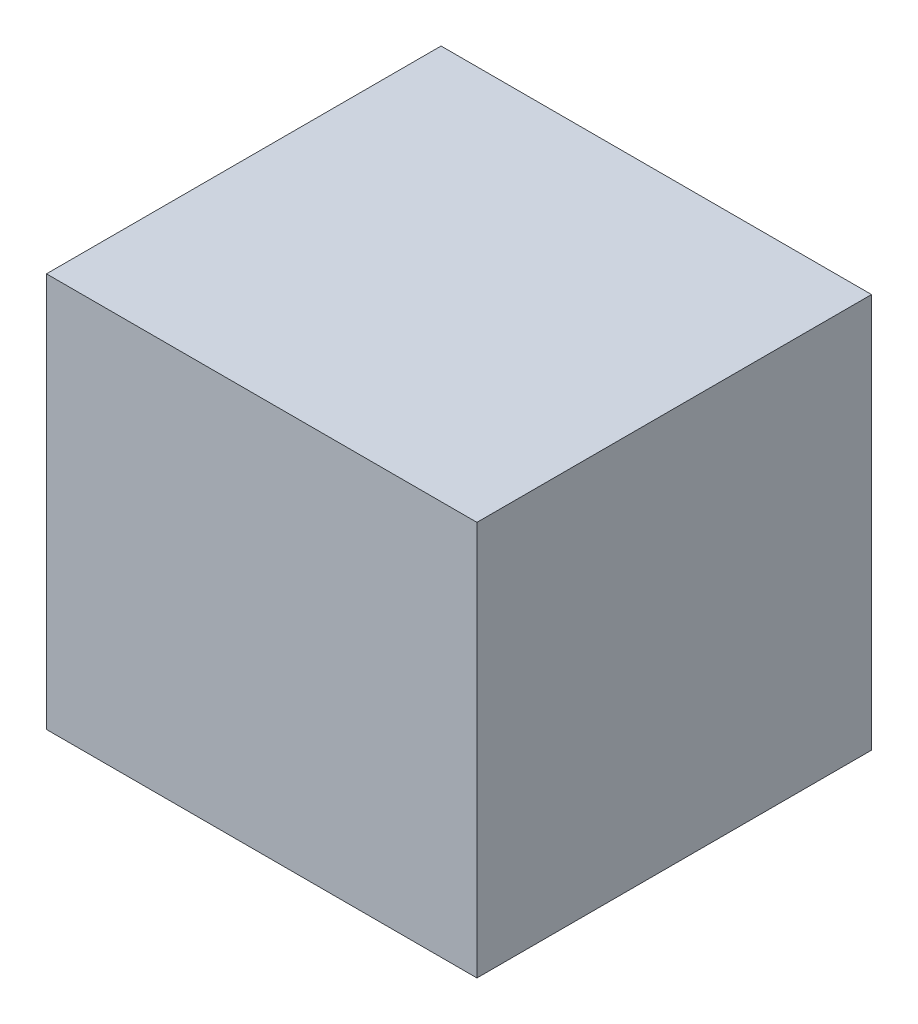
ISO-10303-21;
HEADER;
FILE_DESCRIPTION(('STEP AP214'),'2;1');
FILE_NAME('part.step','',(''),(''),'','','');
FILE_SCHEMA(('AUTOMOTIVE_DESIGN { 1 0 10303 214 1 1 1 1 }'));
ENDSEC;
DATA;
#1=APPLICATION_CONTEXT('core data for automotive mechanical design processes');
#2=APPLICATION_PROTOCOL_DEFINITION('international standard','automotive_design',2000,#1);
#3=PRODUCT_CONTEXT('',#1,'mechanical');
#4=PRODUCT('Part','Part','',(#3));
#5=PRODUCT_RELATED_PRODUCT_CATEGORY('part','',(#4));
#6=PRODUCT_DEFINITION_FORMATION('','',#4);
#7=PRODUCT_DEFINITION_CONTEXT('part definition',#1,'design');
#8=PRODUCT_DEFINITION('design','',#6,#7);
#9=PRODUCT_DEFINITION_SHAPE('','',#8);
#10=(LENGTH_UNIT() NAMED_UNIT(*) SI_UNIT(.MILLI.,.METRE.));
#11=(NAMED_UNIT(*) PLANE_ANGLE_UNIT() SI_UNIT($,.RADIAN.));
#12=(NAMED_UNIT(*) SI_UNIT($,.STERADIAN.) SOLID_ANGLE_UNIT());
#13=UNCERTAINTY_MEASURE_WITH_UNIT(LENGTH_MEASURE(1.E-05),#10,'distance_accuracy_value','');
#14=(GEOMETRIC_REPRESENTATION_CONTEXT(3) GLOBAL_UNCERTAINTY_ASSIGNED_CONTEXT((#13)) GLOBAL_UNIT_ASSIGNED_CONTEXT((#10,
#11,#12)) REPRESENTATION_CONTEXT('',''));
#15=CARTESIAN_POINT('',(0.,0.,0.));
#16=DIRECTION('',(0.,0.,1.));
#17=DIRECTION('',(1.,0.,0.));
#18=AXIS2_PLACEMENT_3D('',#15,#16,#17);
#19=CARTESIAN_POINT('',(120.,0.,0.));
#20=DIRECTION('',(0.,0.,-1.));
#21=DIRECTION('',(-1.,0.,0.));
#22=AXIS2_PLACEMENT_3D('',#19,#20,#21);
#23=PLANE('',#22);
#24=DIRECTION('',(0.,-1.,0.));
#25=VECTOR('',#24,1.);
#26=CARTESIAN_POINT('',(0.,0.,0.));
#27=LINE('',#26,#25);
#28=CARTESIAN_POINT('',(0.,110.,0.));
#29=VERTEX_POINT('',#28);
#30=CARTESIAN_POINT('',(0.,0.,0.));
#31=VERTEX_POINT('',#30);
#32=EDGE_CURVE('E107',#29,#31,#27,.T.);
#33=ORIENTED_EDGE('',*,*,#32,.T.);
#34=DIRECTION('',(-1.,0.,0.));
#35=VECTOR('',#34,1.);
#36=CARTESIAN_POINT('',(120.,0.,0.));
#37=LINE('',#36,#35);
#38=CARTESIAN_POINT('',(120.,0.,0.));
#39=VERTEX_POINT('',#38);
#40=EDGE_CURVE('E11',#39,#31,#37,.T.);
#41=ORIENTED_EDGE('',*,*,#40,.F.);
#42=DIRECTION('',(0.,-1.,0.));
#43=VECTOR('',#42,1.);
#44=CARTESIAN_POINT('',(120.,0.,0.));
#45=LINE('',#44,#43);
#46=CARTESIAN_POINT('',(120.,110.,0.));
#47=VERTEX_POINT('',#46);
#48=EDGE_CURVE('E91',#47,#39,#45,.T.);
#49=ORIENTED_EDGE('',*,*,#48,.F.);
#50=DIRECTION('',(-1.,0.,0.));
#51=VECTOR('',#50,1.);
#52=CARTESIAN_POINT('',(120.,110.,0.));
#53=LINE('',#52,#51);
#54=EDGE_CURVE('E103',#47,#29,#53,.T.);
#55=ORIENTED_EDGE('',*,*,#54,.T.);
#56=EDGE_LOOP('',(#33,#41,#49,#55));
#57=FACE_BOUND('',#56,.T.);
#58=ADVANCED_FACE('F39',(#57),#23,.F.);
#59=CARTESIAN_POINT('',(120.,0.,0.));
#60=DIRECTION('',(0.,1.,0.));
#61=DIRECTION('',(0.,0.,1.));
#62=AXIS2_PLACEMENT_3D('',#59,#60,#61);
#63=PLANE('',#62);
#64=DIRECTION('',(0.,0.,-1.));
#65=VECTOR('',#64,1.);
#66=CARTESIAN_POINT('',(0.,0.,0.));
#67=LINE('',#66,#65);
#68=CARTESIAN_POINT('',(0.,0.,-110.));
#69=VERTEX_POINT('',#68);
#70=EDGE_CURVE('E96',#31,#69,#67,.T.);
#71=ORIENTED_EDGE('',*,*,#70,.T.);
#72=DIRECTION('',(-1.,0.,0.));
#73=VECTOR('',#72,1.);
#74=CARTESIAN_POINT('',(120.,0.,-110.));
#75=LINE('',#74,#73);
#76=CARTESIAN_POINT('',(120.,0.,-110.));
#77=VERTEX_POINT('',#76);
#78=EDGE_CURVE('E48',#77,#69,#75,.T.);
#79=ORIENTED_EDGE('',*,*,#78,.F.);
#80=DIRECTION('',(0.,0.,-1.));
#81=VECTOR('',#80,1.);
#82=CARTESIAN_POINT('',(120.,0.,0.));
#83=LINE('',#82,#81);
#84=EDGE_CURVE('E86',#39,#77,#83,.T.);
#85=ORIENTED_EDGE('',*,*,#84,.F.);
#86=ORIENTED_EDGE('',*,*,#40,.T.);
#87=EDGE_LOOP('',(#71,#79,#85,#86));
#88=FACE_BOUND('',#87,.T.);
#89=ADVANCED_FACE('F95',(#88),#63,.F.);
#90=CARTESIAN_POINT('',(120.,0.,-110.));
#91=DIRECTION('',(0.,0.,1.));
#92=DIRECTION('',(1.,0.,0.));
#93=AXIS2_PLACEMENT_3D('',#90,#91,#92);
#94=PLANE('',#93);
#95=DIRECTION('',(0.,1.,0.));
#96=VECTOR('',#95,1.);
#97=CARTESIAN_POINT('',(0.,0.,-110.));
#98=LINE('',#97,#96);
#99=CARTESIAN_POINT('',(0.,110.,-110.));
#100=VERTEX_POINT('',#99);
#101=EDGE_CURVE('E73',#69,#100,#98,.T.);
#102=ORIENTED_EDGE('',*,*,#101,.T.);
#103=DIRECTION('',(-1.,0.,0.));
#104=VECTOR('',#103,1.);
#105=CARTESIAN_POINT('',(120.,110.,-110.));
#106=LINE('',#105,#104);
#107=CARTESIAN_POINT('',(120.,110.,-110.));
#108=VERTEX_POINT('',#107);
#109=EDGE_CURVE('E98',#108,#100,#106,.T.);
#110=ORIENTED_EDGE('',*,*,#109,.F.);
#111=DIRECTION('',(0.,1.,0.));
#112=VECTOR('',#111,1.);
#113=CARTESIAN_POINT('',(120.,0.,-110.));
#114=LINE('',#113,#112);
#115=EDGE_CURVE('E89',#77,#108,#114,.T.);
#116=ORIENTED_EDGE('',*,*,#115,.F.);
#117=ORIENTED_EDGE('',*,*,#78,.T.);
#118=EDGE_LOOP('',(#102,#110,#116,#117));
#119=FACE_BOUND('',#118,.T.);
#120=ADVANCED_FACE('F99',(#119),#94,.F.);
#121=CARTESIAN_POINT('',(120.,110.,0.));
#122=DIRECTION('',(0.,-1.,0.));
#123=DIRECTION('',(0.,0.,-1.));
#124=AXIS2_PLACEMENT_3D('',#121,#122,#123);
#125=PLANE('',#124);
#126=DIRECTION('',(0.,0.,1.));
#127=VECTOR('',#126,1.);
#128=CARTESIAN_POINT('',(0.,110.,0.));
#129=LINE('',#128,#127);
#130=EDGE_CURVE('E79',#100,#29,#129,.T.);
#131=ORIENTED_EDGE('',*,*,#130,.T.);
#132=ORIENTED_EDGE('',*,*,#54,.F.);
#133=DIRECTION('',(0.,0.,1.));
#134=VECTOR('',#133,1.);
#135=CARTESIAN_POINT('',(120.,110.,0.));
#136=LINE('',#135,#134);
#137=EDGE_CURVE('E56',#108,#47,#136,.T.);
#138=ORIENTED_EDGE('',*,*,#137,.F.);
#139=ORIENTED_EDGE('',*,*,#109,.T.);
#140=EDGE_LOOP('',(#131,#132,#138,#139));
#141=FACE_BOUND('',#140,.T.);
#142=ADVANCED_FACE('F120',(#141),#125,.F.);
#143=CARTESIAN_POINT('',(120.,0.,0.));
#144=DIRECTION('',(-1.,0.,0.));
#145=DIRECTION('',(0.,0.,1.));
#146=AXIS2_PLACEMENT_3D('',#143,#144,#145);
#147=PLANE('',#146);
#148=ORIENTED_EDGE('',*,*,#48,.T.);
#149=ORIENTED_EDGE('',*,*,#84,.T.);
#150=ORIENTED_EDGE('',*,*,#115,.T.);
#151=ORIENTED_EDGE('',*,*,#137,.T.);
#152=EDGE_LOOP('',(#148,#149,#150,#151));
#153=FACE_BOUND('',#152,.T.);
#154=ADVANCED_FACE('F87',(#153),#147,.F.);
#155=CARTESIAN_POINT('',(0.,0.,0.));
#156=DIRECTION('',(-1.,0.,0.));
#157=DIRECTION('',(0.,0.,1.));
#158=AXIS2_PLACEMENT_3D('',#155,#156,#157);
#159=PLANE('',#158);
#160=ORIENTED_EDGE('',*,*,#32,.F.);
#161=ORIENTED_EDGE('',*,*,#130,.F.);
#162=ORIENTED_EDGE('',*,*,#101,.F.);
#163=ORIENTED_EDGE('',*,*,#70,.F.);
#164=EDGE_LOOP('',(#160,#161,#162,#163));
#165=FACE_BOUND('',#164,.T.);
#166=ADVANCED_FACE('F123',(#165),#159,.T.);
#167=CLOSED_SHELL('',(#58,#89,#120,#142,#154,#166));
#168=MANIFOLD_SOLID_BREP('B2',#167);
#169=ADVANCED_BREP_SHAPE_REPRESENTATION('',(#18,#168),#14);
#170=SHAPE_DEFINITION_REPRESENTATION(#9,#169);
ENDSEC;
END-ISO-10303-21;
